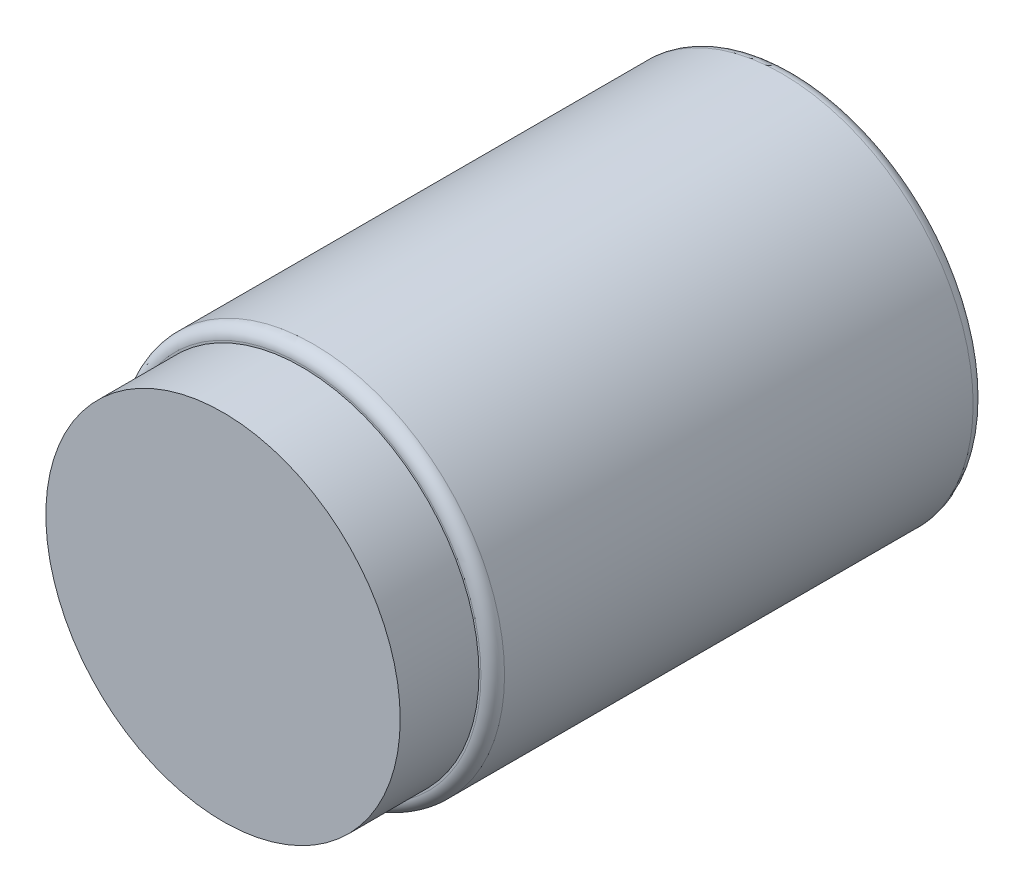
from build123d import *

# Parameters (mm, degrees)
ESQUISSE1_R                  = 48.5
EXTRUSION1_DEPTH             = 125
ESQUISSE2_R                  = 45
EXTRUSION2_DEPTH             = 20
CONG_1_R                     = 3
CONG_2_R                     = 3
ESQUISSE3_R                  = 15
EXTRUSION3_DEPTH             = 5
ENL_V_MAT_EXTRU_1_DEPTH      = 161.404177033
ENL_V_MAT_EXTRU_1_DEPTH_BACK = 161.404177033
ESQUISSE4_R                  = 15


with BuildPart() as part:
    # Esquisse1 → Extrusion1 (new body)
    with BuildSketch(Plane.XY):
        Circle(ESQUISSE1_R)
    extrude(amount=EXTRUSION1_DEPTH)

    # Esquisse2 → Extrusion2 (add)
    with BuildSketch(Plane.XY.offset(125)):
        Circle(ESQUISSE2_R)
    extrude(amount=EXTRUSION2_DEPTH)

    # Cong_1
    cong_1_edges = [part.edges().sort_by_distance(p)[0] for p in [
        (-48.5, 0, 0),
    ]]
    fillet(cong_1_edges, radius=CONG_1_R)

    # Cong_2
    cong_2_edges = [part.edges().sort_by_distance(p)[0] for p in [
        (-48.5, 0, 125),
    ]]
    fillet(cong_2_edges, radius=CONG_2_R)

    # Esquisse3 → Extrusion3 (add)
    with BuildSketch(Plane(origin=(0, 0, 0), x_dir=(-1, 0, 0), z_dir=(0, 0, -1))):
        with Locations(Location((0, 0, 0), (0, 0, 180))):
            Circle(ESQUISSE3_R)
    extrude(amount=EXTRUSION3_DEPTH)

    # Esquisse4 → Enl_v. mat.-Extru.1 (cut, two sides: drawn at the far end of the back side and taken through both)
    with BuildSketch(Plane(origin=(0, 0, 0), x_dir=(1, 0, 0), z_dir=(0, 1, 0)).offset(-ENL_V_MAT_EXTRU_1_DEPTH_BACK)):
        with Locations((0, 15)):
            Circle(ESQUISSE4_R)
    extrude(amount=ENL_V_MAT_EXTRU_1_DEPTH + ENL_V_MAT_EXTRU_1_DEPTH_BACK, mode=Mode.SUBTRACT)


solid = part.part
